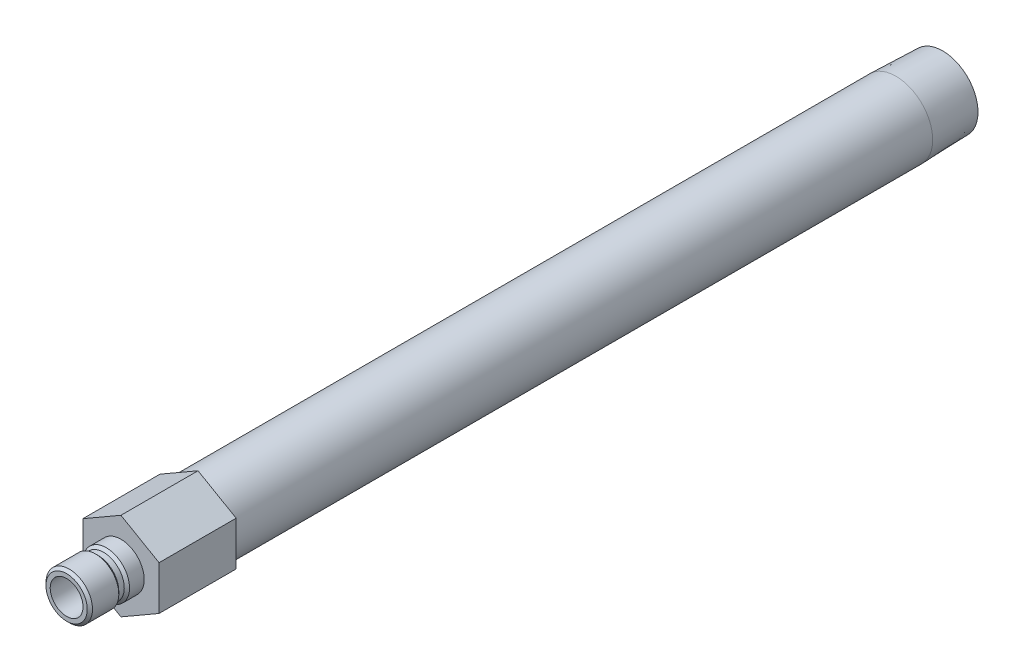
ISO-10303-21;
HEADER;
FILE_DESCRIPTION(('STEP AP214'),'2;1');
FILE_NAME('part.step','',(''),(''),'','','');
FILE_SCHEMA(('AUTOMOTIVE_DESIGN { 1 0 10303 214 1 1 1 1 }'));
ENDSEC;
DATA;
#1=APPLICATION_CONTEXT('core data for automotive mechanical design processes');
#2=APPLICATION_PROTOCOL_DEFINITION('international standard','automotive_design',2000,#1);
#3=PRODUCT_CONTEXT('',#1,'mechanical');
#4=PRODUCT('Part','Part','',(#3));
#5=PRODUCT_RELATED_PRODUCT_CATEGORY('part','',(#4));
#6=PRODUCT_DEFINITION_FORMATION('','',#4);
#7=PRODUCT_DEFINITION_CONTEXT('part definition',#1,'design');
#8=PRODUCT_DEFINITION('design','',#6,#7);
#9=PRODUCT_DEFINITION_SHAPE('','',#8);
#10=(LENGTH_UNIT() NAMED_UNIT(*) SI_UNIT(.MILLI.,.METRE.));
#11=(NAMED_UNIT(*) PLANE_ANGLE_UNIT() SI_UNIT($,.RADIAN.));
#12=(NAMED_UNIT(*) SI_UNIT($,.STERADIAN.) SOLID_ANGLE_UNIT());
#13=UNCERTAINTY_MEASURE_WITH_UNIT(LENGTH_MEASURE(1.E-05),#10,'distance_accuracy_value','');
#14=(GEOMETRIC_REPRESENTATION_CONTEXT(3) GLOBAL_UNCERTAINTY_ASSIGNED_CONTEXT((#13)) GLOBAL_UNIT_ASSIGNED_CONTEXT((#10,
#11,#12)) REPRESENTATION_CONTEXT('',''));
#15=CARTESIAN_POINT('',(0.,0.,0.));
#16=DIRECTION('',(0.,0.,1.));
#17=DIRECTION('',(1.,0.,0.));
#18=AXIS2_PLACEMENT_3D('',#15,#16,#17);
#19=CARTESIAN_POINT('',(0.,0.,0.));
#20=DIRECTION('',(0.,0.,-1.));
#21=DIRECTION('',(0.,1.,0.));
#22=AXIS2_PLACEMENT_3D('',#19,#20,#21);
#23=CYLINDRICAL_SURFACE('',#22,10.668);
#24=CARTESIAN_POINT('',(0.,0.,-224.6884));
#25=DIRECTION('',(0.,0.,-1.));
#26=DIRECTION('',(0.,1.,0.));
#27=AXIS2_PLACEMENT_3D('',#24,#25,#26);
#28=CIRCLE('',#27,10.6679999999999);
#29=CARTESIAN_POINT('',(0.,10.668,-224.6884));
#30=VERTEX_POINT('',#29);
#31=EDGE_CURVE('E168',#30,#30,#28,.T.);
#32=ORIENTED_EDGE('',*,*,#31,.F.);
#33=EDGE_LOOP('',(#32));
#34=FACE_BOUND('',#33,.T.);
#35=CARTESIAN_POINT('',(0.,0.,-22.352));
#36=DIRECTION('',(0.,0.,1.));
#37=DIRECTION('',(1.,0.,0.));
#38=AXIS2_PLACEMENT_3D('',#35,#36,#37);
#39=CIRCLE('',#38,10.668);
#40=CARTESIAN_POINT('',(10.668,0.,-22.352));
#41=VERTEX_POINT('',#40);
#42=EDGE_CURVE('E37',#41,#41,#39,.F.);
#43=ORIENTED_EDGE('',*,*,#42,.T.);
#44=EDGE_LOOP('',(#43));
#45=FACE_BOUND('',#44,.T.);
#46=ADVANCED_FACE('F33',(#34,#45),#23,.T.);
#47=CARTESIAN_POINT('',(0.,0.,0.));
#48=DIRECTION('',(0.,0.,-1.));
#49=DIRECTION('',(0.,1.,0.));
#50=AXIS2_PLACEMENT_3D('',#47,#48,#49);
#51=CYLINDRICAL_SURFACE('',#50,4.76249999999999);
#52=CARTESIAN_POINT('',(0.,0.,15.748));
#53=DIRECTION('',(0.,0.,-1.));
#54=DIRECTION('',(0.,1.,0.));
#55=AXIS2_PLACEMENT_3D('',#52,#53,#54);
#56=CIRCLE('',#55,4.7625);
#57=CARTESIAN_POINT('',(0.,4.7625,15.748));
#58=VERTEX_POINT('',#57);
#59=EDGE_CURVE('E144',#58,#58,#56,.T.);
#60=ORIENTED_EDGE('',*,*,#59,.F.);
#61=EDGE_LOOP('',(#60));
#62=FACE_BOUND('',#61,.T.);
#63=CARTESIAN_POINT('',(0.,0.,-22.352));
#64=DIRECTION('',(0.,0.,-1.));
#65=DIRECTION('',(0.,1.,0.));
#66=AXIS2_PLACEMENT_3D('',#63,#64,#65);
#67=CIRCLE('',#66,4.76249999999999);
#68=CARTESIAN_POINT('',(0.,4.7625,-22.352));
#69=VERTEX_POINT('',#68);
#70=EDGE_CURVE('E11',#69,#69,#67,.T.);
#71=ORIENTED_EDGE('',*,*,#70,.T.);
#72=EDGE_LOOP('',(#71));
#73=FACE_BOUND('',#72,.T.);
#74=ADVANCED_FACE('F35',(#62,#73),#51,.F.);
#75=CARTESIAN_POINT('',(0.,4.7625,-22.352));
#76=DIRECTION('',(0.,0.,-1.));
#77=DIRECTION('',(0.,1.,0.));
#78=AXIS2_PLACEMENT_3D('',#75,#76,#77);
#79=PLANE('',#78);
#80=CARTESIAN_POINT('',(0.,0.,-22.352));
#81=DIRECTION('',(0.,0.,-1.));
#82=DIRECTION('',(0.,1.,0.));
#83=AXIS2_PLACEMENT_3D('',#80,#81,#82);
#84=CIRCLE('',#83,7.89939999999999);
#85=CARTESIAN_POINT('',(0.,7.8994,-22.352));
#86=VERTEX_POINT('',#85);
#87=EDGE_CURVE('E43',#86,#86,#84,.T.);
#88=ORIENTED_EDGE('',*,*,#87,.T.);
#89=EDGE_LOOP('',(#88));
#90=FACE_BOUND('',#89,.T.);
#91=ORIENTED_EDGE('',*,*,#70,.F.);
#92=EDGE_LOOP('',(#91));
#93=FACE_BOUND('',#92,.T.);
#94=ADVANCED_FACE('F180',(#90,#93),#79,.T.);
#95=CARTESIAN_POINT('',(0.,0.,0.));
#96=DIRECTION('',(0.,0.,-1.));
#97=DIRECTION('',(0.,1.,0.));
#98=AXIS2_PLACEMENT_3D('',#95,#96,#97);
#99=CYLINDRICAL_SURFACE('',#98,7.89939999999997);
#100=CARTESIAN_POINT('',(0.,0.,-238.252));
#101=DIRECTION('',(0.,0.,-1.));
#102=DIRECTION('',(0.,1.,0.));
#103=AXIS2_PLACEMENT_3D('',#100,#101,#102);
#104=CIRCLE('',#103,7.89939999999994);
#105=CARTESIAN_POINT('',(0.,7.8994,-238.252));
#106=VERTEX_POINT('',#105);
#107=EDGE_CURVE('E174',#106,#106,#104,.T.);
#108=ORIENTED_EDGE('',*,*,#107,.T.);
#109=EDGE_LOOP('',(#108));
#110=FACE_BOUND('',#109,.T.);
#111=ORIENTED_EDGE('',*,*,#87,.F.);
#112=EDGE_LOOP('',(#111));
#113=FACE_BOUND('',#112,.T.);
#114=ADVANCED_FACE('F183',(#110,#113),#99,.F.);
#115=CARTESIAN_POINT('',(0.,10.244140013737,-238.252));
#116=DIRECTION('',(0.,0.,-1.));
#117=DIRECTION('',(0.,1.,0.));
#118=AXIS2_PLACEMENT_3D('',#115,#116,#117);
#119=PLANE('',#118);
#120=CARTESIAN_POINT('',(0.,0.,-238.252));
#121=DIRECTION('',(0.,0.,-1.));
#122=DIRECTION('',(0.,1.,0.));
#123=AXIS2_PLACEMENT_3D('',#120,#121,#122);
#124=CIRCLE('',#123,10.2441400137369);
#125=CARTESIAN_POINT('',(0.,10.244140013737,-238.252));
#126=VERTEX_POINT('',#125);
#127=EDGE_CURVE('E171',#126,#126,#124,.T.);
#128=ORIENTED_EDGE('',*,*,#127,.T.);
#129=EDGE_LOOP('',(#128));
#130=FACE_BOUND('',#129,.T.);
#131=ORIENTED_EDGE('',*,*,#107,.F.);
#132=EDGE_LOOP('',(#131));
#133=FACE_BOUND('',#132,.T.);
#134=ADVANCED_FACE('F185',(#130,#133),#119,.T.);
#135=CARTESIAN_POINT('',(0.,0.,-238.252));
#136=DIRECTION('',(0.,0.,1.));
#137=DIRECTION('',(0.,-1.,0.));
#138=AXIS2_PLACEMENT_3D('',#135,#136,#137);
#139=CONICAL_SURFACE('',#138,10.2441400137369,0.0312396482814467);
#140=ORIENTED_EDGE('',*,*,#31,.T.);
#141=EDGE_LOOP('',(#140));
#142=FACE_BOUND('',#141,.T.);
#143=ORIENTED_EDGE('',*,*,#127,.F.);
#144=EDGE_LOOP('',(#143));
#145=FACE_BOUND('',#144,.T.);
#146=ADVANCED_FACE('F192',(#142,#145),#139,.T.);
#147=CARTESIAN_POINT('',(0.,6.7437,0.));
#148=DIRECTION('',(0.,0.,1.));
#149=DIRECTION('',(0.,-1.,0.));
#150=AXIS2_PLACEMENT_3D('',#147,#148,#149);
#151=PLANE('',#150);
#152=CARTESIAN_POINT('',(0.,0.,0.));
#153=DIRECTION('',(0.,0.,-1.));
#154=DIRECTION('',(0.,1.,0.));
#155=AXIS2_PLACEMENT_3D('',#152,#153,#154);
#156=CIRCLE('',#155,6.7437);
#157=CARTESIAN_POINT('',(0.,6.7437,0.));
#158=VERTEX_POINT('',#157);
#159=EDGE_CURVE('E165',#158,#158,#156,.T.);
#160=ORIENTED_EDGE('',*,*,#159,.T.);
#161=EDGE_LOOP('',(#160));
#162=FACE_BOUND('',#161,.T.);
#163=DIRECTION('',(-0.866025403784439,-0.5,0.));
#164=VECTOR('',#163,1.);
#165=CARTESIAN_POINT('',(0.,12.7582862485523,0.));
#166=LINE('',#165,#164);
#167=CARTESIAN_POINT('',(0.,12.7582862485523,0.));
#168=VERTEX_POINT('',#167);
#169=CARTESIAN_POINT('',(-11.049,6.37914312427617,0.));
#170=VERTEX_POINT('',#169);
#171=EDGE_CURVE('E122',#168,#170,#166,.T.);
#172=ORIENTED_EDGE('',*,*,#171,.T.);
#173=DIRECTION('',(0.,-1.,0.));
#174=VECTOR('',#173,1.);
#175=CARTESIAN_POINT('',(-11.049,6.37914312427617,0.));
#176=LINE('',#175,#174);
#177=CARTESIAN_POINT('',(-11.049,-6.37914312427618,0.));
#178=VERTEX_POINT('',#177);
#179=EDGE_CURVE('E125',#170,#178,#176,.T.);
#180=ORIENTED_EDGE('',*,*,#179,.T.);
#181=DIRECTION('',(0.866025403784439,-0.5,0.));
#182=VECTOR('',#181,1.);
#183=CARTESIAN_POINT('',(-11.049,-6.37914312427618,0.));
#184=LINE('',#183,#182);
#185=CARTESIAN_POINT('',(0.,-12.7582862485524,0.));
#186=VERTEX_POINT('',#185);
#187=EDGE_CURVE('E128',#178,#186,#184,.T.);
#188=ORIENTED_EDGE('',*,*,#187,.T.);
#189=DIRECTION('',(0.866025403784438,0.5,0.));
#190=VECTOR('',#189,1.);
#191=CARTESIAN_POINT('',(0.,-12.7582862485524,0.));
#192=LINE('',#191,#190);
#193=CARTESIAN_POINT('',(11.049,-6.37914312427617,0.));
#194=VERTEX_POINT('',#193);
#195=EDGE_CURVE('E131',#186,#194,#192,.T.);
#196=ORIENTED_EDGE('',*,*,#195,.T.);
#197=DIRECTION('',(0.,1.,0.));
#198=VECTOR('',#197,1.);
#199=CARTESIAN_POINT('',(11.049,-6.37914312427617,0.));
#200=LINE('',#199,#198);
#201=CARTESIAN_POINT('',(11.049,6.37914312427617,0.));
#202=VERTEX_POINT('',#201);
#203=EDGE_CURVE('E99',#194,#202,#200,.T.);
#204=ORIENTED_EDGE('',*,*,#203,.T.);
#205=DIRECTION('',(-0.866025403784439,0.5,0.));
#206=VECTOR('',#205,1.);
#207=CARTESIAN_POINT('',(11.049,6.37914312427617,0.));
#208=LINE('',#207,#206);
#209=EDGE_CURVE('E134',#202,#168,#208,.T.);
#210=ORIENTED_EDGE('',*,*,#209,.T.);
#211=EDGE_LOOP('',(#172,#180,#188,#196,#204,#210));
#212=FACE_BOUND('',#211,.T.);
#213=ADVANCED_FACE('F206',(#162,#212),#151,.T.);
#214=CARTESIAN_POINT('',(0.,0.,0.));
#215=DIRECTION('',(0.,0.,-1.));
#216=DIRECTION('',(0.,1.,0.));
#217=AXIS2_PLACEMENT_3D('',#214,#215,#216);
#218=CYLINDRICAL_SURFACE('',#217,6.7437);
#219=CARTESIAN_POINT('',(0.,0.,4.25449999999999));
#220=DIRECTION('',(0.,0.,-1.));
#221=DIRECTION('',(0.,1.,0.));
#222=AXIS2_PLACEMENT_3D('',#219,#220,#221);
#223=CIRCLE('',#222,6.7437);
#224=CARTESIAN_POINT('',(0.,6.7437,4.25449999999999));
#225=VERTEX_POINT('',#224);
#226=EDGE_CURVE('E162',#225,#225,#223,.T.);
#227=ORIENTED_EDGE('',*,*,#226,.T.);
#228=EDGE_LOOP('',(#227));
#229=FACE_BOUND('',#228,.T.);
#230=ORIENTED_EDGE('',*,*,#159,.F.);
#231=EDGE_LOOP('',(#230));
#232=FACE_BOUND('',#231,.T.);
#233=ADVANCED_FACE('F213',(#229,#232),#218,.T.);
#234=CARTESIAN_POINT('',(0.,0.,4.25449999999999));
#235=DIRECTION('',(0.,0.,-1.));
#236=DIRECTION('',(0.,1.,0.));
#237=AXIS2_PLACEMENT_3D('',#234,#235,#236);
#238=CONICAL_SURFACE('',#237,6.7437,0.785398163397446);
#239=CARTESIAN_POINT('',(0.,0.,5.0165));
#240=DIRECTION('',(0.,0.,-1.));
#241=DIRECTION('',(0.,1.,0.));
#242=AXIS2_PLACEMENT_3D('',#239,#240,#241);
#243=CIRCLE('',#242,5.9817);
#244=CARTESIAN_POINT('',(0.,5.9817,5.0165));
#245=VERTEX_POINT('',#244);
#246=EDGE_CURVE('E159',#245,#245,#243,.T.);
#247=ORIENTED_EDGE('',*,*,#246,.T.);
#248=EDGE_LOOP('',(#247));
#249=FACE_BOUND('',#248,.T.);
#250=ORIENTED_EDGE('',*,*,#226,.F.);
#251=EDGE_LOOP('',(#250));
#252=FACE_BOUND('',#251,.T.);
#253=ADVANCED_FACE('F222',(#249,#252),#238,.T.);
#254=CARTESIAN_POINT('',(0.,0.,0.));
#255=DIRECTION('',(0.,0.,-1.));
#256=DIRECTION('',(0.,1.,0.));
#257=AXIS2_PLACEMENT_3D('',#254,#255,#256);
#258=CYLINDRICAL_SURFACE('',#257,5.9817);
#259=CARTESIAN_POINT('',(0.,0.,6.604));
#260=DIRECTION('',(0.,0.,-1.));
#261=DIRECTION('',(0.,1.,0.));
#262=AXIS2_PLACEMENT_3D('',#259,#260,#261);
#263=CIRCLE('',#262,5.9817);
#264=CARTESIAN_POINT('',(0.,5.9817,6.604));
#265=VERTEX_POINT('',#264);
#266=EDGE_CURVE('E156',#265,#265,#263,.T.);
#267=ORIENTED_EDGE('',*,*,#266,.T.);
#268=EDGE_LOOP('',(#267));
#269=FACE_BOUND('',#268,.T.);
#270=ORIENTED_EDGE('',*,*,#246,.F.);
#271=EDGE_LOOP('',(#270));
#272=FACE_BOUND('',#271,.T.);
#273=ADVANCED_FACE('F263',(#269,#272),#258,.T.);
#274=CARTESIAN_POINT('',(0.,0.,6.604));
#275=DIRECTION('',(0.,0.,1.));
#276=DIRECTION('',(0.,-1.,0.));
#277=AXIS2_PLACEMENT_3D('',#274,#275,#276);
#278=CONICAL_SURFACE('',#277,5.9817,0.785398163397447);
#279=CARTESIAN_POINT('',(0.,0.,7.366));
#280=DIRECTION('',(0.,0.,-1.));
#281=DIRECTION('',(0.,1.,0.));
#282=AXIS2_PLACEMENT_3D('',#279,#280,#281);
#283=CIRCLE('',#282,6.7437);
#284=CARTESIAN_POINT('',(0.,6.7437,7.366));
#285=VERTEX_POINT('',#284);
#286=EDGE_CURVE('E153',#285,#285,#283,.T.);
#287=ORIENTED_EDGE('',*,*,#286,.T.);
#288=EDGE_LOOP('',(#287));
#289=FACE_BOUND('',#288,.T.);
#290=ORIENTED_EDGE('',*,*,#266,.F.);
#291=EDGE_LOOP('',(#290));
#292=FACE_BOUND('',#291,.T.);
#293=ADVANCED_FACE('F259',(#289,#292),#278,.T.);
#294=CARTESIAN_POINT('',(0.,0.,0.));
#295=DIRECTION('',(0.,0.,-1.));
#296=DIRECTION('',(0.,1.,0.));
#297=AXIS2_PLACEMENT_3D('',#294,#295,#296);
#298=CYLINDRICAL_SURFACE('',#297,6.7437);
#299=CARTESIAN_POINT('',(0.,0.,14.986));
#300=DIRECTION('',(0.,0.,-1.));
#301=DIRECTION('',(0.,1.,0.));
#302=AXIS2_PLACEMENT_3D('',#299,#300,#301);
#303=CIRCLE('',#302,6.7437);
#304=CARTESIAN_POINT('',(0.,6.7437,14.986));
#305=VERTEX_POINT('',#304);
#306=EDGE_CURVE('E150',#305,#305,#303,.T.);
#307=ORIENTED_EDGE('',*,*,#306,.T.);
#308=EDGE_LOOP('',(#307));
#309=FACE_BOUND('',#308,.T.);
#310=ORIENTED_EDGE('',*,*,#286,.F.);
#311=EDGE_LOOP('',(#310));
#312=FACE_BOUND('',#311,.T.);
#313=ADVANCED_FACE('F255',(#309,#312),#298,.T.);
#314=CARTESIAN_POINT('',(0.,0.,14.986));
#315=DIRECTION('',(0.,0.,-1.));
#316=DIRECTION('',(0.,1.,0.));
#317=AXIS2_PLACEMENT_3D('',#314,#315,#316);
#318=CONICAL_SURFACE('',#317,6.7437,0.785398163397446);
#319=CARTESIAN_POINT('',(0.,0.,15.748));
#320=DIRECTION('',(0.,0.,-1.));
#321=DIRECTION('',(0.,1.,0.));
#322=AXIS2_PLACEMENT_3D('',#319,#320,#321);
#323=CIRCLE('',#322,5.9817);
#324=CARTESIAN_POINT('',(0.,5.9817,15.748));
#325=VERTEX_POINT('',#324);
#326=EDGE_CURVE('E147',#325,#325,#323,.T.);
#327=ORIENTED_EDGE('',*,*,#326,.T.);
#328=EDGE_LOOP('',(#327));
#329=FACE_BOUND('',#328,.T.);
#330=ORIENTED_EDGE('',*,*,#306,.F.);
#331=EDGE_LOOP('',(#330));
#332=FACE_BOUND('',#331,.T.);
#333=ADVANCED_FACE('F251',(#329,#332),#318,.T.);
#334=CARTESIAN_POINT('',(0.,4.7625,15.748));
#335=DIRECTION('',(0.,0.,1.));
#336=DIRECTION('',(0.,-1.,0.));
#337=AXIS2_PLACEMENT_3D('',#334,#335,#336);
#338=PLANE('',#337);
#339=ORIENTED_EDGE('',*,*,#59,.T.);
#340=EDGE_LOOP('',(#339));
#341=FACE_BOUND('',#340,.T.);
#342=ORIENTED_EDGE('',*,*,#326,.F.);
#343=EDGE_LOOP('',(#342));
#344=FACE_BOUND('',#343,.T.);
#345=ADVANCED_FACE('F239',(#341,#344),#338,.T.);
#346=CARTESIAN_POINT('',(0.,12.7582862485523,-22.352));
#347=DIRECTION('',(-0.5,0.866025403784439,0.));
#348=DIRECTION('',(-0.866025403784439,-0.5,0.));
#349=AXIS2_PLACEMENT_3D('',#346,#347,#348);
#350=PLANE('',#349);
#351=ORIENTED_EDGE('',*,*,#171,.F.);
#352=DIRECTION('',(0.,0.,1.));
#353=VECTOR('',#352,1.);
#354=CARTESIAN_POINT('',(0.,12.7582862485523,-22.352));
#355=LINE('',#354,#353);
#356=CARTESIAN_POINT('',(0.,12.7582862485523,-22.352));
#357=VERTEX_POINT('',#356);
#358=EDGE_CURVE('E51',#357,#168,#355,.T.);
#359=ORIENTED_EDGE('',*,*,#358,.F.);
#360=DIRECTION('',(-0.866025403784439,-0.5,0.));
#361=VECTOR('',#360,1.);
#362=CARTESIAN_POINT('',(0.,12.7582862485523,-22.352));
#363=LINE('',#362,#361);
#364=CARTESIAN_POINT('',(-11.049,6.37914312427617,-22.352));
#365=VERTEX_POINT('',#364);
#366=EDGE_CURVE('E137',#357,#365,#363,.T.);
#367=ORIENTED_EDGE('',*,*,#366,.T.);
#368=DIRECTION('',(0.,0.,1.));
#369=VECTOR('',#368,1.);
#370=CARTESIAN_POINT('',(-11.049,6.37914312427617,-22.352));
#371=LINE('',#370,#369);
#372=EDGE_CURVE('E86',#365,#170,#371,.T.);
#373=ORIENTED_EDGE('',*,*,#372,.T.);
#374=EDGE_LOOP('',(#351,#359,#367,#373));
#375=FACE_BOUND('',#374,.T.);
#376=ADVANCED_FACE('F226',(#375),#350,.T.);
#377=CARTESIAN_POINT('',(11.049,6.37914312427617,-22.352));
#378=DIRECTION('',(0.5,0.866025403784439,0.));
#379=DIRECTION('',(-0.866025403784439,0.5,0.));
#380=AXIS2_PLACEMENT_3D('',#377,#378,#379);
#381=PLANE('',#380);
#382=ORIENTED_EDGE('',*,*,#209,.F.);
#383=DIRECTION('',(0.,0.,1.));
#384=VECTOR('',#383,1.);
#385=CARTESIAN_POINT('',(11.049,6.37914312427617,-22.352));
#386=LINE('',#385,#384);
#387=CARTESIAN_POINT('',(11.049,6.37914312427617,-22.352));
#388=VERTEX_POINT('',#387);
#389=EDGE_CURVE('E74',#388,#202,#386,.T.);
#390=ORIENTED_EDGE('',*,*,#389,.F.);
#391=DIRECTION('',(-0.866025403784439,0.5,0.));
#392=VECTOR('',#391,1.);
#393=CARTESIAN_POINT('',(11.049,6.37914312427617,-22.352));
#394=LINE('',#393,#392);
#395=EDGE_CURVE('E112',#388,#357,#394,.T.);
#396=ORIENTED_EDGE('',*,*,#395,.T.);
#397=ORIENTED_EDGE('',*,*,#358,.T.);
#398=EDGE_LOOP('',(#382,#390,#396,#397));
#399=FACE_BOUND('',#398,.T.);
#400=ADVANCED_FACE('F231',(#399),#381,.T.);
#401=CARTESIAN_POINT('',(11.049,-6.37914312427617,-22.352));
#402=DIRECTION('',(1.,0.,0.));
#403=DIRECTION('',(0.,0.,-1.));
#404=AXIS2_PLACEMENT_3D('',#401,#402,#403);
#405=PLANE('',#404);
#406=ORIENTED_EDGE('',*,*,#203,.F.);
#407=DIRECTION('',(0.,0.,1.));
#408=VECTOR('',#407,1.);
#409=CARTESIAN_POINT('',(11.049,-6.37914312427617,-22.352));
#410=LINE('',#409,#408);
#411=CARTESIAN_POINT('',(11.049,-6.37914312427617,-22.352));
#412=VERTEX_POINT('',#411);
#413=EDGE_CURVE('E94',#412,#194,#410,.T.);
#414=ORIENTED_EDGE('',*,*,#413,.F.);
#415=DIRECTION('',(0.,1.,0.));
#416=VECTOR('',#415,1.);
#417=CARTESIAN_POINT('',(11.049,-6.37914312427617,-22.352));
#418=LINE('',#417,#416);
#419=EDGE_CURVE('E97',#412,#388,#418,.T.);
#420=ORIENTED_EDGE('',*,*,#419,.T.);
#421=ORIENTED_EDGE('',*,*,#389,.T.);
#422=EDGE_LOOP('',(#406,#414,#420,#421));
#423=FACE_BOUND('',#422,.T.);
#424=ADVANCED_FACE('F96',(#423),#405,.T.);
#425=CARTESIAN_POINT('',(0.,-12.7582862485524,-22.352));
#426=DIRECTION('',(0.5,-0.866025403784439,0.));
#427=DIRECTION('',(0.866025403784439,0.5,0.));
#428=AXIS2_PLACEMENT_3D('',#425,#426,#427);
#429=PLANE('',#428);
#430=ORIENTED_EDGE('',*,*,#195,.F.);
#431=DIRECTION('',(0.,0.,1.));
#432=VECTOR('',#431,1.);
#433=CARTESIAN_POINT('',(0.,-12.7582862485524,-22.352));
#434=LINE('',#433,#432);
#435=CARTESIAN_POINT('',(0.,-12.7582862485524,-22.352));
#436=VERTEX_POINT('',#435);
#437=EDGE_CURVE('E104',#436,#186,#434,.T.);
#438=ORIENTED_EDGE('',*,*,#437,.F.);
#439=DIRECTION('',(0.866025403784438,0.5,0.));
#440=VECTOR('',#439,1.);
#441=CARTESIAN_POINT('',(0.,-12.7582862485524,-22.352));
#442=LINE('',#441,#440);
#443=EDGE_CURVE('E110',#436,#412,#442,.T.);
#444=ORIENTED_EDGE('',*,*,#443,.T.);
#445=ORIENTED_EDGE('',*,*,#413,.T.);
#446=EDGE_LOOP('',(#430,#438,#444,#445));
#447=FACE_BOUND('',#446,.T.);
#448=ADVANCED_FACE('F114',(#447),#429,.T.);
#449=CARTESIAN_POINT('',(-11.049,-6.37914312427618,-22.352));
#450=DIRECTION('',(-0.5,-0.866025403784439,0.));
#451=DIRECTION('',(0.866025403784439,-0.5,0.));
#452=AXIS2_PLACEMENT_3D('',#449,#450,#451);
#453=PLANE('',#452);
#454=ORIENTED_EDGE('',*,*,#187,.F.);
#455=DIRECTION('',(0.,0.,1.));
#456=VECTOR('',#455,1.);
#457=CARTESIAN_POINT('',(-11.049,-6.37914312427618,-22.352));
#458=LINE('',#457,#456);
#459=CARTESIAN_POINT('',(-11.049,-6.37914312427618,-22.352));
#460=VERTEX_POINT('',#459);
#461=EDGE_CURVE('E141',#460,#178,#458,.T.);
#462=ORIENTED_EDGE('',*,*,#461,.F.);
#463=DIRECTION('',(0.866025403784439,-0.5,0.));
#464=VECTOR('',#463,1.);
#465=CARTESIAN_POINT('',(-11.049,-6.37914312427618,-22.352));
#466=LINE('',#465,#464);
#467=EDGE_CURVE('E115',#460,#436,#466,.T.);
#468=ORIENTED_EDGE('',*,*,#467,.T.);
#469=ORIENTED_EDGE('',*,*,#437,.T.);
#470=EDGE_LOOP('',(#454,#462,#468,#469));
#471=FACE_BOUND('',#470,.T.);
#472=ADVANCED_FACE('F230',(#471),#453,.T.);
#473=CARTESIAN_POINT('',(-11.049,6.37914312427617,-22.352));
#474=DIRECTION('',(-1.,0.,0.));
#475=DIRECTION('',(0.,0.,1.));
#476=AXIS2_PLACEMENT_3D('',#473,#474,#475);
#477=PLANE('',#476);
#478=ORIENTED_EDGE('',*,*,#179,.F.);
#479=ORIENTED_EDGE('',*,*,#372,.F.);
#480=DIRECTION('',(0.,-1.,0.));
#481=VECTOR('',#480,1.);
#482=CARTESIAN_POINT('',(-11.049,6.37914312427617,-22.352));
#483=LINE('',#482,#481);
#484=EDGE_CURVE('E117',#365,#460,#483,.T.);
#485=ORIENTED_EDGE('',*,*,#484,.T.);
#486=ORIENTED_EDGE('',*,*,#461,.T.);
#487=EDGE_LOOP('',(#478,#479,#485,#486));
#488=FACE_BOUND('',#487,.T.);
#489=ADVANCED_FACE('F227',(#488),#477,.T.);
#490=CARTESIAN_POINT('',(-11.049,6.37914312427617,-22.352));
#491=DIRECTION('',(0.,0.,1.));
#492=DIRECTION('',(1.,0.,0.));
#493=AXIS2_PLACEMENT_3D('',#490,#491,#492);
#494=PLANE('',#493);
#495=ORIENTED_EDGE('',*,*,#42,.F.);
#496=EDGE_LOOP('',(#495));
#497=FACE_BOUND('',#496,.T.);
#498=ORIENTED_EDGE('',*,*,#366,.F.);
#499=ORIENTED_EDGE('',*,*,#395,.F.);
#500=ORIENTED_EDGE('',*,*,#419,.F.);
#501=ORIENTED_EDGE('',*,*,#443,.F.);
#502=ORIENTED_EDGE('',*,*,#467,.F.);
#503=ORIENTED_EDGE('',*,*,#484,.F.);
#504=EDGE_LOOP('',(#498,#499,#500,#501,#502,#503));
#505=FACE_BOUND('',#504,.T.);
#506=ADVANCED_FACE('F108',(#497,#505),#494,.F.);
#507=CLOSED_SHELL('',(#46,#74,#94,#114,#134,#146,#213,#233,#253,#273,#293,#313,#333,#345,#376,
#400,#424,#448,#472,#489,#506));
#508=MANIFOLD_SOLID_BREP('B2',#507);
#509=ADVANCED_BREP_SHAPE_REPRESENTATION('',(#18,#508),#14);
#510=SHAPE_DEFINITION_REPRESENTATION(#9,#509);
ENDSEC;
END-ISO-10303-21;
